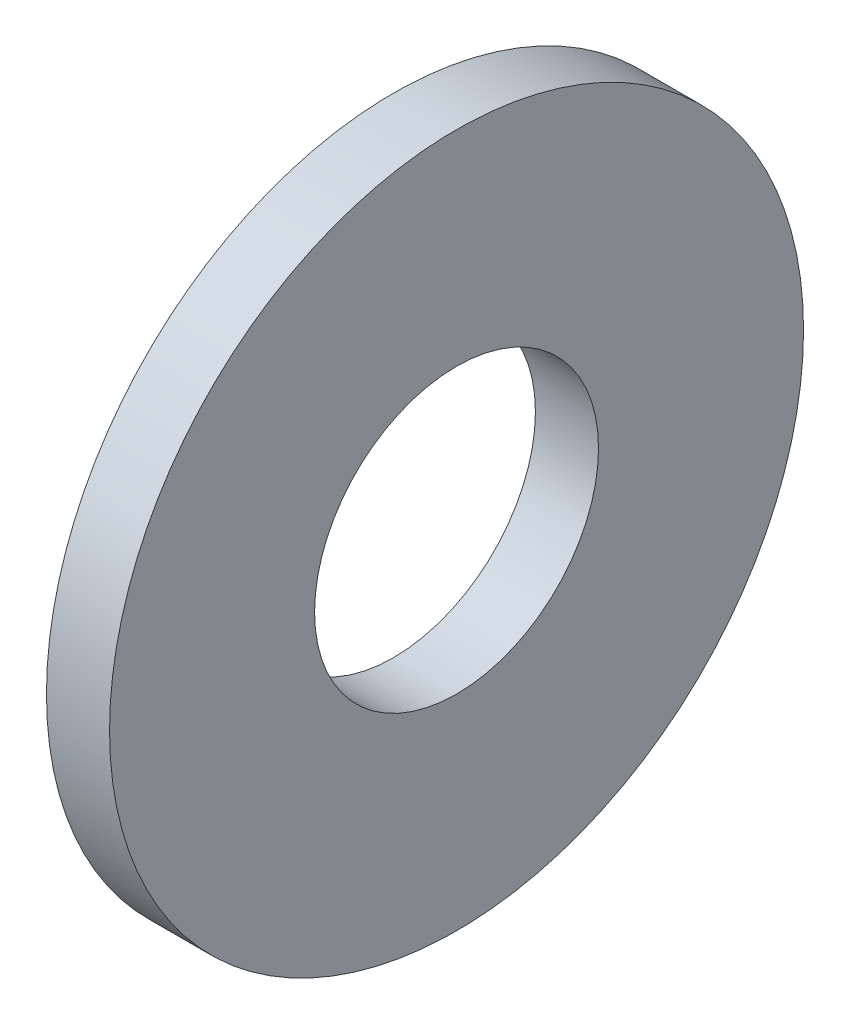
from build123d import *

# Parameters (mm, degrees)
ESQUISSE2_W = 1
ESQUISSE2_H = 3.25


with BuildPart() as part:
    # Esquisse2 → R_volution1 (revolve)
    with BuildSketch(Plane.XY, mode=Mode.PRIVATE) as r_volution1_sk:
        with Locations((0.5, 3.875)):
            Rectangle(ESQUISSE2_W, ESQUISSE2_H)
    revolve(r_volution1_sk.sketch.rotate(Axis((-7.455836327, 0, 0), (1, 0, 0)), 90), axis=Axis((-7.455836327, 0, 0), (1, 0, 0)))


solid = part.part
